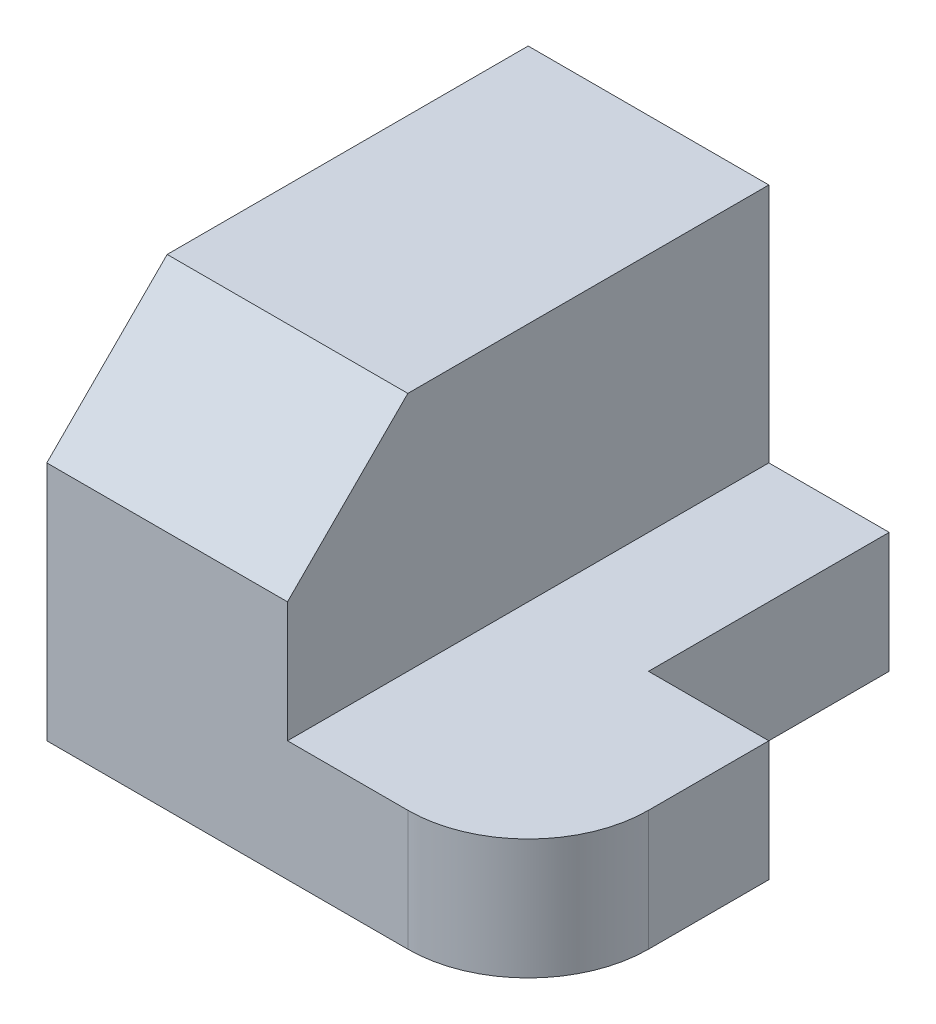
from build123d import *

# Parameters (mm, degrees)
EXTRUDE1_DEPTH = 10
SKETCH2_W      = 20
SKETCH2_H      = 40
EXTRUDE2_DEPTH = 20
FILLET1_R      = 10
CHAMFER1_SIZE  = 10


with BuildPart() as part:
    # Sketch1 → Extrude1 (new body)
    with BuildSketch(Plane(origin=(0, 0, 0), x_dir=(1, 0, 0), z_dir=(0, 1, 0))):
        Polygon((0, 0), (0, -40), (40, -40), (40, -20), (30, -20), (30, 0), align=None)
    extrude(amount=EXTRUDE1_DEPTH)

    # Sketch2 → Extrude2 (add)
    with BuildSketch(Plane(origin=(0, 10, 0), x_dir=(1, 0, 0), z_dir=(0, 1, 0))):
        with Locations((10, -20)):
            Rectangle(SKETCH2_W, SKETCH2_H)
    extrude(amount=EXTRUDE2_DEPTH)

    # Fillet1
    fillet1_edges = [part.edges().sort_by_distance(p)[0] for p in [
        (40, 5, 40),
    ]]
    fillet(fillet1_edges, radius=FILLET1_R)

    # Chamfer1
    chamfer1_edges = [part.edges().sort_by_distance(p)[0] for p in [
        (10, 30, 40),
    ]]
    chamfer(chamfer1_edges, length=CHAMFER1_SIZE)


solid = part.part
